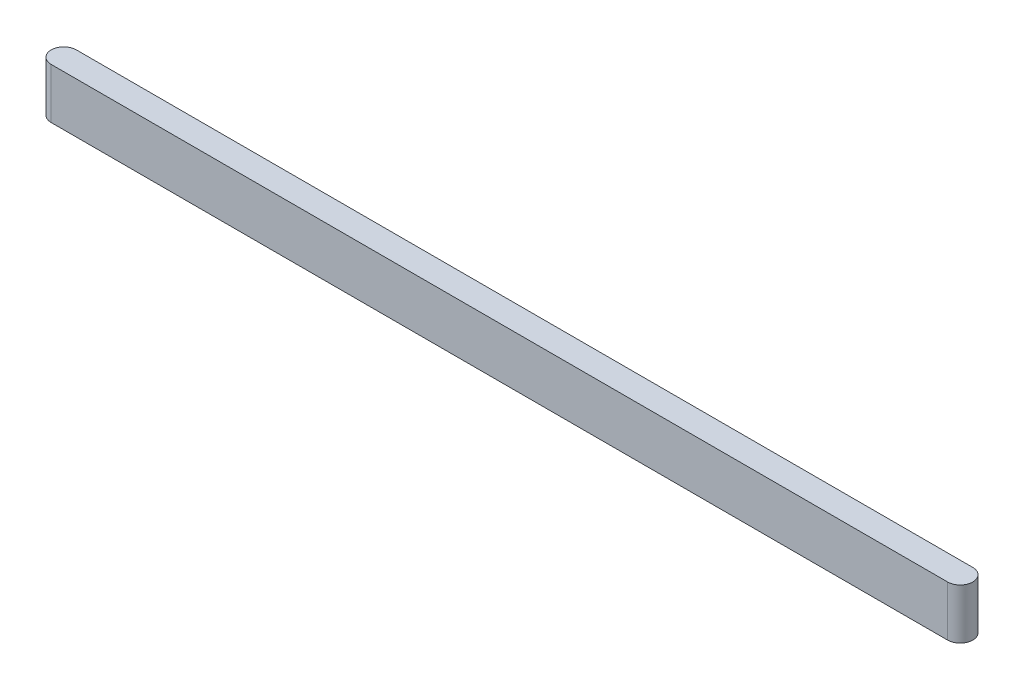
from build123d import *

# Parameters (mm, degrees)
ESQUISSE1_W          = 10
ESQUISSE1_H          = 20
BASE_EXTRUSION_DEPTH = 178
ESQUISSE2_R          = 5
BOSS_EXTRU_1_DEPTH   = 20


with BuildPart() as part:
    # Esquisse1 → Base-Extrusion (new, symmetric)
    with BuildSketch(Plane(origin=(0, 0, 0), x_dir=(0, 0, -1), z_dir=(1, 0, 0))):
        with Locations((0, -10)):
            Rectangle(ESQUISSE1_W, ESQUISSE1_H)
    extrude(amount=BASE_EXTRUSION_DEPTH, both=True)

    # Esquisse2 → Boss.-Extru.1 (add)
    with BuildSketch(Plane(origin=(0, 0, 0), x_dir=(-1, 0, 0), z_dir=(0, 1, 0))):
        with Locations((-178, 0)):
            Circle(ESQUISSE2_R)
        with Locations((178, 0)):
            Circle(ESQUISSE2_R)
    extrude(amount=-BOSS_EXTRU_1_DEPTH)


solid = part.part
